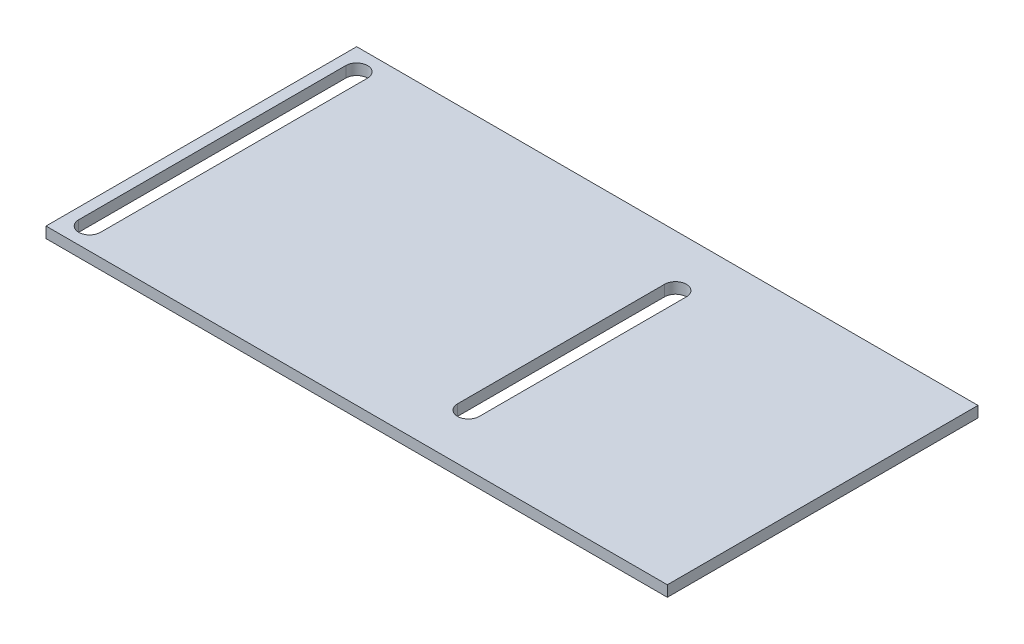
ISO-10303-21;
HEADER;
FILE_DESCRIPTION(('STEP AP214'),'2;1');
FILE_NAME('part.step','',(''),(''),'','','');
FILE_SCHEMA(('AUTOMOTIVE_DESIGN { 1 0 10303 214 1 1 1 1 }'));
ENDSEC;
DATA;
#1=APPLICATION_CONTEXT('core data for automotive mechanical design processes');
#2=APPLICATION_PROTOCOL_DEFINITION('international standard','automotive_design',2000,#1);
#3=PRODUCT_CONTEXT('',#1,'mechanical');
#4=PRODUCT('Part','Part','',(#3));
#5=PRODUCT_RELATED_PRODUCT_CATEGORY('part','',(#4));
#6=PRODUCT_DEFINITION_FORMATION('','',#4);
#7=PRODUCT_DEFINITION_CONTEXT('part definition',#1,'design');
#8=PRODUCT_DEFINITION('design','',#6,#7);
#9=PRODUCT_DEFINITION_SHAPE('','',#8);
#10=(LENGTH_UNIT() NAMED_UNIT(*) SI_UNIT(.MILLI.,.METRE.));
#11=(NAMED_UNIT(*) PLANE_ANGLE_UNIT() SI_UNIT($,.RADIAN.));
#12=(NAMED_UNIT(*) SI_UNIT($,.STERADIAN.) SOLID_ANGLE_UNIT());
#13=UNCERTAINTY_MEASURE_WITH_UNIT(LENGTH_MEASURE(1.E-05),#10,'distance_accuracy_value','');
#14=(GEOMETRIC_REPRESENTATION_CONTEXT(3) GLOBAL_UNCERTAINTY_ASSIGNED_CONTEXT((#13)) GLOBAL_UNIT_ASSIGNED_CONTEXT((#10,
#11,#12)) REPRESENTATION_CONTEXT('',''));
#15=CARTESIAN_POINT('',(0.,0.,0.));
#16=DIRECTION('',(0.,0.,1.));
#17=DIRECTION('',(1.,0.,0.));
#18=AXIS2_PLACEMENT_3D('',#15,#16,#17);
#19=CARTESIAN_POINT('',(57.,2.,28.5));
#20=DIRECTION('',(-1.,0.,0.));
#21=DIRECTION('',(0.,0.,1.));
#22=AXIS2_PLACEMENT_3D('',#19,#20,#21);
#23=PLANE('',#22);
#24=DIRECTION('',(0.,0.,-1.));
#25=VECTOR('',#24,1.);
#26=CARTESIAN_POINT('',(57.,0.,28.5));
#27=LINE('',#26,#25);
#28=CARTESIAN_POINT('',(57.,0.,28.5));
#29=VERTEX_POINT('',#28);
#30=CARTESIAN_POINT('',(57.,0.,-28.5));
#31=VERTEX_POINT('',#30);
#32=EDGE_CURVE('E183',#29,#31,#27,.T.);
#33=ORIENTED_EDGE('',*,*,#32,.T.);
#34=DIRECTION('',(0.,-1.,0.));
#35=VECTOR('',#34,1.);
#36=CARTESIAN_POINT('',(57.,2.,-28.5));
#37=LINE('',#36,#35);
#38=CARTESIAN_POINT('',(57.,2.,-28.5));
#39=VERTEX_POINT('',#38);
#40=EDGE_CURVE('E11',#39,#31,#37,.T.);
#41=ORIENTED_EDGE('',*,*,#40,.F.);
#42=DIRECTION('',(0.,0.,-1.));
#43=VECTOR('',#42,1.);
#44=CARTESIAN_POINT('',(57.,2.,28.5));
#45=LINE('',#44,#43);
#46=CARTESIAN_POINT('',(57.,2.,28.5));
#47=VERTEX_POINT('',#46);
#48=EDGE_CURVE('E190',#47,#39,#45,.T.);
#49=ORIENTED_EDGE('',*,*,#48,.F.);
#50=DIRECTION('',(0.,-1.,0.));
#51=VECTOR('',#50,1.);
#52=CARTESIAN_POINT('',(57.,2.,28.5));
#53=LINE('',#52,#51);
#54=EDGE_CURVE('E200',#47,#29,#53,.T.);
#55=ORIENTED_EDGE('',*,*,#54,.T.);
#56=EDGE_LOOP('',(#33,#41,#49,#55));
#57=FACE_BOUND('',#56,.T.);
#58=ADVANCED_FACE('F33',(#57),#23,.F.);
#59=CARTESIAN_POINT('',(-57.,2.,-28.5));
#60=DIRECTION('',(0.,0.,1.));
#61=DIRECTION('',(1.,0.,0.));
#62=AXIS2_PLACEMENT_3D('',#59,#60,#61);
#63=PLANE('',#62);
#64=DIRECTION('',(-1.,0.,0.));
#65=VECTOR('',#64,1.);
#66=CARTESIAN_POINT('',(-57.,0.,-28.5));
#67=LINE('',#66,#65);
#68=CARTESIAN_POINT('',(-57.,0.,-28.5));
#69=VERTEX_POINT('',#68);
#70=EDGE_CURVE('E203',#31,#69,#67,.T.);
#71=ORIENTED_EDGE('',*,*,#70,.T.);
#72=DIRECTION('',(0.,-1.,0.));
#73=VECTOR('',#72,1.);
#74=CARTESIAN_POINT('',(-57.,2.,-28.5));
#75=LINE('',#74,#73);
#76=CARTESIAN_POINT('',(-57.,2.,-28.5));
#77=VERTEX_POINT('',#76);
#78=EDGE_CURVE('E40',#77,#69,#75,.T.);
#79=ORIENTED_EDGE('',*,*,#78,.F.);
#80=DIRECTION('',(-1.,0.,0.));
#81=VECTOR('',#80,1.);
#82=CARTESIAN_POINT('',(-57.,2.,-28.5));
#83=LINE('',#82,#81);
#84=EDGE_CURVE('E193',#39,#77,#83,.T.);
#85=ORIENTED_EDGE('',*,*,#84,.F.);
#86=ORIENTED_EDGE('',*,*,#40,.T.);
#87=EDGE_LOOP('',(#71,#79,#85,#86));
#88=FACE_BOUND('',#87,.T.);
#89=ADVANCED_FACE('F232',(#88),#63,.F.);
#90=CARTESIAN_POINT('',(-57.,2.,28.5));
#91=DIRECTION('',(1.,0.,0.));
#92=DIRECTION('',(0.,0.,-1.));
#93=AXIS2_PLACEMENT_3D('',#90,#91,#92);
#94=PLANE('',#93);
#95=DIRECTION('',(0.,0.,1.));
#96=VECTOR('',#95,1.);
#97=CARTESIAN_POINT('',(-57.,0.,28.5));
#98=LINE('',#97,#96);
#99=CARTESIAN_POINT('',(-57.,0.,28.5));
#100=VERTEX_POINT('',#99);
#101=EDGE_CURVE('E205',#69,#100,#98,.T.);
#102=ORIENTED_EDGE('',*,*,#101,.T.);
#103=DIRECTION('',(0.,-1.,0.));
#104=VECTOR('',#103,1.);
#105=CARTESIAN_POINT('',(-57.,2.,28.5));
#106=LINE('',#105,#104);
#107=CARTESIAN_POINT('',(-57.,2.,28.5));
#108=VERTEX_POINT('',#107);
#109=EDGE_CURVE('E210',#108,#100,#106,.T.);
#110=ORIENTED_EDGE('',*,*,#109,.F.);
#111=DIRECTION('',(0.,0.,1.));
#112=VECTOR('',#111,1.);
#113=CARTESIAN_POINT('',(-57.,2.,28.5));
#114=LINE('',#113,#112);
#115=EDGE_CURVE('E196',#77,#108,#114,.T.);
#116=ORIENTED_EDGE('',*,*,#115,.F.);
#117=ORIENTED_EDGE('',*,*,#78,.T.);
#118=EDGE_LOOP('',(#102,#110,#116,#117));
#119=FACE_BOUND('',#118,.T.);
#120=ADVANCED_FACE('F217',(#119),#94,.F.);
#121=CARTESIAN_POINT('',(-57.,2.,28.5));
#122=DIRECTION('',(0.,0.,-1.));
#123=DIRECTION('',(-1.,0.,0.));
#124=AXIS2_PLACEMENT_3D('',#121,#122,#123);
#125=PLANE('',#124);
#126=DIRECTION('',(1.,0.,0.));
#127=VECTOR('',#126,1.);
#128=CARTESIAN_POINT('',(-57.,0.,28.5));
#129=LINE('',#128,#127);
#130=EDGE_CURVE('E194',#100,#29,#129,.T.);
#131=ORIENTED_EDGE('',*,*,#130,.T.);
#132=ORIENTED_EDGE('',*,*,#54,.F.);
#133=DIRECTION('',(1.,0.,0.));
#134=VECTOR('',#133,1.);
#135=CARTESIAN_POINT('',(-57.,2.,28.5));
#136=LINE('',#135,#134);
#137=EDGE_CURVE('E198',#108,#47,#136,.T.);
#138=ORIENTED_EDGE('',*,*,#137,.F.);
#139=ORIENTED_EDGE('',*,*,#109,.T.);
#140=EDGE_LOOP('',(#131,#132,#138,#139));
#141=FACE_BOUND('',#140,.T.);
#142=ADVANCED_FACE('F225',(#141),#125,.F.);
#143=CARTESIAN_POINT('',(0.,2.,0.));
#144=DIRECTION('',(0.,-1.,0.));
#145=DIRECTION('',(0.,0.,-1.));
#146=AXIS2_PLACEMENT_3D('',#143,#144,#145);
#147=PLANE('',#146);
#148=DIRECTION('',(0.,0.,1.));
#149=VECTOR('',#148,1.);
#150=CARTESIAN_POINT('',(8.99999999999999,2.,-19.));
#151=LINE('',#150,#149);
#152=CARTESIAN_POINT('',(8.99999999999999,2.,-19.));
#153=VERTEX_POINT('',#152);
#154=CARTESIAN_POINT('',(9.,2.,19.));
#155=VERTEX_POINT('',#154);
#156=EDGE_CURVE('E148',#153,#155,#151,.T.);
#157=ORIENTED_EDGE('',*,*,#156,.F.);
#158=CARTESIAN_POINT('',(11.,2.,-19.));
#159=DIRECTION('',(0.,1.,0.));
#160=DIRECTION('',(0.,0.,1.));
#161=AXIS2_PLACEMENT_3D('',#158,#159,#160);
#162=CIRCLE('',#161,2.00000000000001);
#163=CARTESIAN_POINT('',(13.,2.,-19.));
#164=VERTEX_POINT('',#163);
#165=EDGE_CURVE('E47',#164,#153,#162,.T.);
#166=ORIENTED_EDGE('',*,*,#165,.F.);
#167=DIRECTION('',(0.,0.,-1.));
#168=VECTOR('',#167,1.);
#169=CARTESIAN_POINT('',(13.,2.,-19.));
#170=LINE('',#169,#168);
#171=CARTESIAN_POINT('',(13.,2.,19.));
#172=VERTEX_POINT('',#171);
#173=EDGE_CURVE('E139',#172,#164,#170,.T.);
#174=ORIENTED_EDGE('',*,*,#173,.F.);
#175=CARTESIAN_POINT('',(11.,2.,19.));
#176=DIRECTION('',(0.,1.,0.));
#177=DIRECTION('',(0.,0.,1.));
#178=AXIS2_PLACEMENT_3D('',#175,#176,#177);
#179=CIRCLE('',#178,2.00000000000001);
#180=EDGE_CURVE('E142',#155,#172,#179,.T.);
#181=ORIENTED_EDGE('',*,*,#180,.F.);
#182=EDGE_LOOP('',(#157,#166,#174,#181));
#183=FACE_BOUND('',#182,.T.);
#184=DIRECTION('',(0.,0.,-1.));
#185=VECTOR('',#184,1.);
#186=CARTESIAN_POINT('',(-51.,2.,24.5));
#187=LINE('',#186,#185);
#188=CARTESIAN_POINT('',(-51.,2.,24.5));
#189=VERTEX_POINT('',#188);
#190=CARTESIAN_POINT('',(-51.,2.,-24.5));
#191=VERTEX_POINT('',#190);
#192=EDGE_CURVE('E173',#189,#191,#187,.T.);
#193=ORIENTED_EDGE('',*,*,#192,.F.);
#194=CARTESIAN_POINT('',(-53.,2.,24.5));
#195=DIRECTION('',(0.,1.,0.));
#196=DIRECTION('',(0.,0.,1.));
#197=AXIS2_PLACEMENT_3D('',#194,#195,#196);
#198=CIRCLE('',#197,1.99999999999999);
#199=CARTESIAN_POINT('',(-55.,2.,24.5));
#200=VERTEX_POINT('',#199);
#201=EDGE_CURVE('E154',#200,#189,#198,.T.);
#202=ORIENTED_EDGE('',*,*,#201,.F.);
#203=DIRECTION('',(0.,0.,1.));
#204=VECTOR('',#203,1.);
#205=CARTESIAN_POINT('',(-55.,2.,24.5));
#206=LINE('',#205,#204);
#207=CARTESIAN_POINT('',(-55.,2.,-24.5));
#208=VERTEX_POINT('',#207);
#209=EDGE_CURVE('E162',#208,#200,#206,.T.);
#210=ORIENTED_EDGE('',*,*,#209,.F.);
#211=CARTESIAN_POINT('',(-53.,2.,-24.5));
#212=DIRECTION('',(0.,1.,0.));
#213=DIRECTION('',(0.,0.,1.));
#214=AXIS2_PLACEMENT_3D('',#211,#212,#213);
#215=CIRCLE('',#214,2.);
#216=EDGE_CURVE('E176',#191,#208,#215,.T.);
#217=ORIENTED_EDGE('',*,*,#216,.F.);
#218=EDGE_LOOP('',(#193,#202,#210,#217));
#219=FACE_BOUND('',#218,.T.);
#220=ORIENTED_EDGE('',*,*,#48,.T.);
#221=ORIENTED_EDGE('',*,*,#84,.T.);
#222=ORIENTED_EDGE('',*,*,#115,.T.);
#223=ORIENTED_EDGE('',*,*,#137,.T.);
#224=EDGE_LOOP('',(#220,#221,#222,#223));
#225=FACE_BOUND('',#224,.T.);
#226=ADVANCED_FACE('F231',(#183,#219,#225),#147,.F.);
#227=CARTESIAN_POINT('',(0.,0.,0.));
#228=DIRECTION('',(0.,-1.,0.));
#229=DIRECTION('',(0.,0.,-1.));
#230=AXIS2_PLACEMENT_3D('',#227,#228,#229);
#231=PLANE('',#230);
#232=CARTESIAN_POINT('',(11.,0.,-19.));
#233=DIRECTION('',(0.,1.,0.));
#234=DIRECTION('',(0.,0.,1.));
#235=AXIS2_PLACEMENT_3D('',#232,#233,#234);
#236=CIRCLE('',#235,2.00000000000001);
#237=CARTESIAN_POINT('',(13.,0.,-19.));
#238=VERTEX_POINT('',#237);
#239=CARTESIAN_POINT('',(8.99999999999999,0.,-19.));
#240=VERTEX_POINT('',#239);
#241=EDGE_CURVE('E123',#238,#240,#236,.T.);
#242=ORIENTED_EDGE('',*,*,#241,.T.);
#243=DIRECTION('',(0.,0.,1.));
#244=VECTOR('',#243,1.);
#245=CARTESIAN_POINT('',(8.99999999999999,0.,-19.));
#246=LINE('',#245,#244);
#247=CARTESIAN_POINT('',(9.,0.,19.));
#248=VERTEX_POINT('',#247);
#249=EDGE_CURVE('E132',#240,#248,#246,.T.);
#250=ORIENTED_EDGE('',*,*,#249,.T.);
#251=CARTESIAN_POINT('',(11.,0.,19.));
#252=DIRECTION('',(0.,1.,0.));
#253=DIRECTION('',(0.,0.,1.));
#254=AXIS2_PLACEMENT_3D('',#251,#252,#253);
#255=CIRCLE('',#254,2.00000000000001);
#256=CARTESIAN_POINT('',(13.,0.,19.));
#257=VERTEX_POINT('',#256);
#258=EDGE_CURVE('E55',#248,#257,#255,.T.);
#259=ORIENTED_EDGE('',*,*,#258,.T.);
#260=DIRECTION('',(0.,0.,-1.));
#261=VECTOR('',#260,1.);
#262=CARTESIAN_POINT('',(13.,0.,-19.));
#263=LINE('',#262,#261);
#264=EDGE_CURVE('E129',#257,#238,#263,.T.);
#265=ORIENTED_EDGE('',*,*,#264,.T.);
#266=EDGE_LOOP('',(#242,#250,#259,#265));
#267=FACE_BOUND('',#266,.T.);
#268=CARTESIAN_POINT('',(-53.,0.,24.5));
#269=DIRECTION('',(0.,1.,0.));
#270=DIRECTION('',(0.,0.,1.));
#271=AXIS2_PLACEMENT_3D('',#268,#269,#270);
#272=CIRCLE('',#271,1.99999999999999);
#273=CARTESIAN_POINT('',(-55.,0.,24.5));
#274=VERTEX_POINT('',#273);
#275=CARTESIAN_POINT('',(-51.,0.,24.5));
#276=VERTEX_POINT('',#275);
#277=EDGE_CURVE('E158',#274,#276,#272,.T.);
#278=ORIENTED_EDGE('',*,*,#277,.T.);
#279=DIRECTION('',(0.,0.,-1.));
#280=VECTOR('',#279,1.);
#281=CARTESIAN_POINT('',(-51.,0.,24.5));
#282=LINE('',#281,#280);
#283=CARTESIAN_POINT('',(-51.,0.,-24.5));
#284=VERTEX_POINT('',#283);
#285=EDGE_CURVE('E161',#276,#284,#282,.T.);
#286=ORIENTED_EDGE('',*,*,#285,.T.);
#287=CARTESIAN_POINT('',(-53.,0.,-24.5));
#288=DIRECTION('',(0.,1.,0.));
#289=DIRECTION('',(0.,0.,1.));
#290=AXIS2_PLACEMENT_3D('',#287,#288,#289);
#291=CIRCLE('',#290,2.);
#292=CARTESIAN_POINT('',(-55.,0.,-24.5));
#293=VERTEX_POINT('',#292);
#294=EDGE_CURVE('E165',#284,#293,#291,.T.);
#295=ORIENTED_EDGE('',*,*,#294,.T.);
#296=DIRECTION('',(0.,0.,1.));
#297=VECTOR('',#296,1.);
#298=CARTESIAN_POINT('',(-55.,0.,24.5));
#299=LINE('',#298,#297);
#300=EDGE_CURVE('E168',#293,#274,#299,.T.);
#301=ORIENTED_EDGE('',*,*,#300,.T.);
#302=EDGE_LOOP('',(#278,#286,#295,#301));
#303=FACE_BOUND('',#302,.T.);
#304=ORIENTED_EDGE('',*,*,#32,.F.);
#305=ORIENTED_EDGE('',*,*,#130,.F.);
#306=ORIENTED_EDGE('',*,*,#101,.F.);
#307=ORIENTED_EDGE('',*,*,#70,.F.);
#308=EDGE_LOOP('',(#304,#305,#306,#307));
#309=FACE_BOUND('',#308,.T.);
#310=ADVANCED_FACE('F136',(#267,#303,#309),#231,.T.);
#311=CARTESIAN_POINT('',(-53.,0.,24.5));
#312=DIRECTION('',(0.,1.,0.));
#313=DIRECTION('',(0.,0.,1.));
#314=AXIS2_PLACEMENT_3D('',#311,#312,#313);
#315=CYLINDRICAL_SURFACE('',#314,1.99999999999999);
#316=ORIENTED_EDGE('',*,*,#201,.T.);
#317=DIRECTION('',(0.,1.,0.));
#318=VECTOR('',#317,1.);
#319=CARTESIAN_POINT('',(-51.,0.,24.5));
#320=LINE('',#319,#318);
#321=EDGE_CURVE('E171',#276,#189,#320,.T.);
#322=ORIENTED_EDGE('',*,*,#321,.F.);
#323=ORIENTED_EDGE('',*,*,#277,.F.);
#324=DIRECTION('',(0.,1.,0.));
#325=VECTOR('',#324,1.);
#326=CARTESIAN_POINT('',(-55.,0.,24.5));
#327=LINE('',#326,#325);
#328=EDGE_CURVE('E181',#274,#200,#327,.T.);
#329=ORIENTED_EDGE('',*,*,#328,.T.);
#330=EDGE_LOOP('',(#316,#322,#323,#329));
#331=FACE_BOUND('',#330,.T.);
#332=ADVANCED_FACE('F244',(#331),#315,.F.);
#333=CARTESIAN_POINT('',(-55.,0.,24.5));
#334=DIRECTION('',(-1.,0.,0.));
#335=DIRECTION('',(0.,0.,1.));
#336=AXIS2_PLACEMENT_3D('',#333,#334,#335);
#337=PLANE('',#336);
#338=ORIENTED_EDGE('',*,*,#209,.T.);
#339=ORIENTED_EDGE('',*,*,#328,.F.);
#340=ORIENTED_EDGE('',*,*,#300,.F.);
#341=DIRECTION('',(0.,1.,0.));
#342=VECTOR('',#341,1.);
#343=CARTESIAN_POINT('',(-55.,0.,-24.5));
#344=LINE('',#343,#342);
#345=EDGE_CURVE('E184',#293,#208,#344,.T.);
#346=ORIENTED_EDGE('',*,*,#345,.T.);
#347=EDGE_LOOP('',(#338,#339,#340,#346));
#348=FACE_BOUND('',#347,.T.);
#349=ADVANCED_FACE('F250',(#348),#337,.F.);
#350=CARTESIAN_POINT('',(-53.,0.,-24.5));
#351=DIRECTION('',(0.,1.,0.));
#352=DIRECTION('',(0.,0.,1.));
#353=AXIS2_PLACEMENT_3D('',#350,#351,#352);
#354=CYLINDRICAL_SURFACE('',#353,2.);
#355=ORIENTED_EDGE('',*,*,#216,.T.);
#356=ORIENTED_EDGE('',*,*,#345,.F.);
#357=ORIENTED_EDGE('',*,*,#294,.F.);
#358=DIRECTION('',(0.,1.,0.));
#359=VECTOR('',#358,1.);
#360=CARTESIAN_POINT('',(-51.,0.,-24.5));
#361=LINE('',#360,#359);
#362=EDGE_CURVE('E186',#284,#191,#361,.T.);
#363=ORIENTED_EDGE('',*,*,#362,.T.);
#364=EDGE_LOOP('',(#355,#356,#357,#363));
#365=FACE_BOUND('',#364,.T.);
#366=ADVANCED_FACE('F255',(#365),#354,.F.);
#367=CARTESIAN_POINT('',(-51.,0.,24.5));
#368=DIRECTION('',(1.,0.,0.));
#369=DIRECTION('',(0.,0.,-1.));
#370=AXIS2_PLACEMENT_3D('',#367,#368,#369);
#371=PLANE('',#370);
#372=ORIENTED_EDGE('',*,*,#192,.T.);
#373=ORIENTED_EDGE('',*,*,#362,.F.);
#374=ORIENTED_EDGE('',*,*,#285,.F.);
#375=ORIENTED_EDGE('',*,*,#321,.T.);
#376=EDGE_LOOP('',(#372,#373,#374,#375));
#377=FACE_BOUND('',#376,.T.);
#378=ADVANCED_FACE('F252',(#377),#371,.F.);
#379=CARTESIAN_POINT('',(11.,0.,-19.));
#380=DIRECTION('',(0.,1.,0.));
#381=DIRECTION('',(0.,0.,1.));
#382=AXIS2_PLACEMENT_3D('',#379,#380,#381);
#383=CYLINDRICAL_SURFACE('',#382,2.00000000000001);
#384=ORIENTED_EDGE('',*,*,#165,.T.);
#385=DIRECTION('',(0.,1.,0.));
#386=VECTOR('',#385,1.);
#387=CARTESIAN_POINT('',(8.99999999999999,0.,-19.));
#388=LINE('',#387,#386);
#389=EDGE_CURVE('E119',#240,#153,#388,.T.);
#390=ORIENTED_EDGE('',*,*,#389,.F.);
#391=ORIENTED_EDGE('',*,*,#241,.F.);
#392=DIRECTION('',(0.,1.,0.));
#393=VECTOR('',#392,1.);
#394=CARTESIAN_POINT('',(13.,0.,-19.));
#395=LINE('',#394,#393);
#396=EDGE_CURVE('E152',#238,#164,#395,.T.);
#397=ORIENTED_EDGE('',*,*,#396,.T.);
#398=EDGE_LOOP('',(#384,#390,#391,#397));
#399=FACE_BOUND('',#398,.T.);
#400=ADVANCED_FACE('F121',(#399),#383,.F.);
#401=CARTESIAN_POINT('',(13.,0.,-19.));
#402=DIRECTION('',(1.,0.,0.));
#403=DIRECTION('',(0.,0.,-1.));
#404=AXIS2_PLACEMENT_3D('',#401,#402,#403);
#405=PLANE('',#404);
#406=ORIENTED_EDGE('',*,*,#173,.T.);
#407=ORIENTED_EDGE('',*,*,#396,.F.);
#408=ORIENTED_EDGE('',*,*,#264,.F.);
#409=DIRECTION('',(0.,1.,0.));
#410=VECTOR('',#409,1.);
#411=CARTESIAN_POINT('',(13.,0.,19.));
#412=LINE('',#411,#410);
#413=EDGE_CURVE('E155',#257,#172,#412,.T.);
#414=ORIENTED_EDGE('',*,*,#413,.T.);
#415=EDGE_LOOP('',(#406,#407,#408,#414));
#416=FACE_BOUND('',#415,.T.);
#417=ADVANCED_FACE('F265',(#416),#405,.F.);
#418=CARTESIAN_POINT('',(11.,0.,19.));
#419=DIRECTION('',(0.,1.,0.));
#420=DIRECTION('',(0.,0.,1.));
#421=AXIS2_PLACEMENT_3D('',#418,#419,#420);
#422=CYLINDRICAL_SURFACE('',#421,2.00000000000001);
#423=ORIENTED_EDGE('',*,*,#180,.T.);
#424=ORIENTED_EDGE('',*,*,#413,.F.);
#425=ORIENTED_EDGE('',*,*,#258,.F.);
#426=DIRECTION('',(0.,1.,0.));
#427=VECTOR('',#426,1.);
#428=CARTESIAN_POINT('',(9.,0.,19.));
#429=LINE('',#428,#427);
#430=EDGE_CURVE('E128',#248,#155,#429,.T.);
#431=ORIENTED_EDGE('',*,*,#430,.T.);
#432=EDGE_LOOP('',(#423,#424,#425,#431));
#433=FACE_BOUND('',#432,.T.);
#434=ADVANCED_FACE('F268',(#433),#422,.F.);
#435=CARTESIAN_POINT('',(8.99999999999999,0.,-19.));
#436=DIRECTION('',(-1.,0.,0.));
#437=DIRECTION('',(0.,0.,1.));
#438=AXIS2_PLACEMENT_3D('',#435,#436,#437);
#439=PLANE('',#438);
#440=ORIENTED_EDGE('',*,*,#156,.T.);
#441=ORIENTED_EDGE('',*,*,#430,.F.);
#442=ORIENTED_EDGE('',*,*,#249,.F.);
#443=ORIENTED_EDGE('',*,*,#389,.T.);
#444=EDGE_LOOP('',(#440,#441,#442,#443));
#445=FACE_BOUND('',#444,.T.);
#446=ADVANCED_FACE('F133',(#445),#439,.F.);
#447=CLOSED_SHELL('',(#58,#89,#120,#142,#226,#310,#332,#349,#366,#378,#400,#417,#434,#446));
#448=MANIFOLD_SOLID_BREP('B2',#447);
#449=ADVANCED_BREP_SHAPE_REPRESENTATION('',(#18,#448),#14);
#450=SHAPE_DEFINITION_REPRESENTATION(#9,#449);
ENDSEC;
END-ISO-10303-21;
